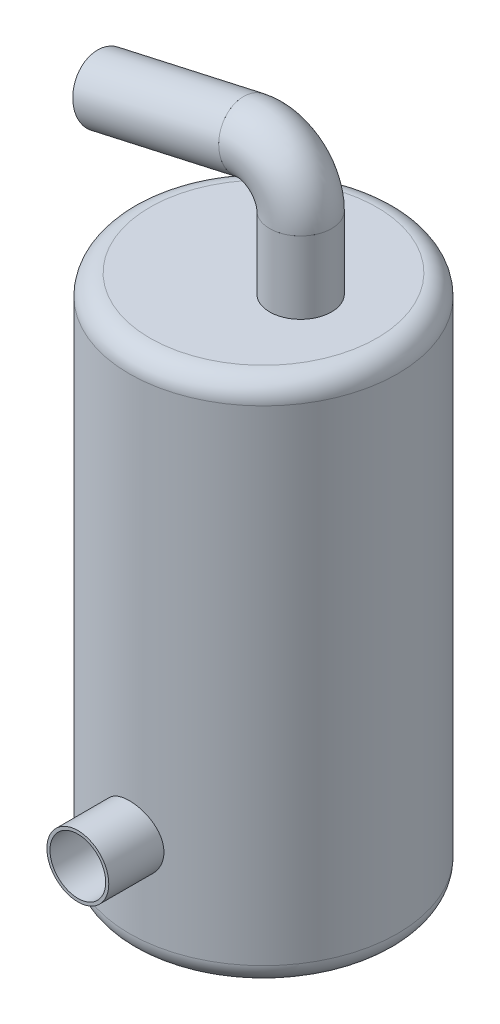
ISO-10303-21;
HEADER;
FILE_DESCRIPTION(('STEP AP214'),'2;1');
FILE_NAME('part.step','',(''),(''),'','','');
FILE_SCHEMA(('AUTOMOTIVE_DESIGN { 1 0 10303 214 1 1 1 1 }'));
ENDSEC;
DATA;
#1=APPLICATION_CONTEXT('core data for automotive mechanical design processes');
#2=APPLICATION_PROTOCOL_DEFINITION('international standard','automotive_design',2000,#1);
#3=PRODUCT_CONTEXT('',#1,'mechanical');
#4=PRODUCT('Part','Part','',(#3));
#5=PRODUCT_RELATED_PRODUCT_CATEGORY('part','',(#4));
#6=PRODUCT_DEFINITION_FORMATION('','',#4);
#7=PRODUCT_DEFINITION_CONTEXT('part definition',#1,'design');
#8=PRODUCT_DEFINITION('design','',#6,#7);
#9=PRODUCT_DEFINITION_SHAPE('','',#8);
#10=(LENGTH_UNIT() NAMED_UNIT(*) SI_UNIT(.MILLI.,.METRE.));
#11=(NAMED_UNIT(*) PLANE_ANGLE_UNIT() SI_UNIT($,.RADIAN.));
#12=(NAMED_UNIT(*) SI_UNIT($,.STERADIAN.) SOLID_ANGLE_UNIT());
#13=UNCERTAINTY_MEASURE_WITH_UNIT(LENGTH_MEASURE(1.E-05),#10,'distance_accuracy_value','');
#14=(GEOMETRIC_REPRESENTATION_CONTEXT(3) GLOBAL_UNCERTAINTY_ASSIGNED_CONTEXT((#13)) GLOBAL_UNIT_ASSIGNED_CONTEXT((#10,
#11,#12)) REPRESENTATION_CONTEXT('',''));
#15=CARTESIAN_POINT('',(0.,0.,0.));
#16=DIRECTION('',(0.,0.,1.));
#17=DIRECTION('',(1.,0.,0.));
#18=AXIS2_PLACEMENT_3D('',#15,#16,#17);
#19=CARTESIAN_POINT('',(-77.11683006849,293.702950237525,0.));
#20=DIRECTION('',(0.975916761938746,0.218143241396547,0.));
#21=DIRECTION('',(-0.218143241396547,0.975916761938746,0.));
#22=AXIS2_PLACEMENT_3D('',#19,#20,#21);
#23=CYLINDRICAL_SURFACE('',#22,13.5);
#24=CARTESIAN_POINT('',(-77.11683006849,293.702950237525,0.));
#25=DIRECTION('',(-0.975916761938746,-0.218143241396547,0.));
#26=DIRECTION('',(0.,0.,1.));
#27=AXIS2_PLACEMENT_3D('',#24,#25,#26);
#28=CIRCLE('',#27,13.5);
#29=CARTESIAN_POINT('',(-77.11683006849,293.702950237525,13.5));
#30=VERTEX_POINT('',#29);
#31=EDGE_CURVE('E50',#30,#30,#28,.T.);
#32=ORIENTED_EDGE('',*,*,#31,.T.);
#33=EDGE_LOOP('',(#32));
#34=FACE_BOUND('',#33,.T.);
#35=CARTESIAN_POINT('',(-6.36286482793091,309.518335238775,0.));
#36=DIRECTION('',(-0.975916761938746,-0.218143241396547,0.));
#37=DIRECTION('',(0.,0.,1.));
#38=AXIS2_PLACEMENT_3D('',#35,#36,#37);
#39=CIRCLE('',#38,13.5);
#40=CARTESIAN_POINT('',(-6.36286482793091,309.518335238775,13.5));
#41=VERTEX_POINT('',#40);
#42=EDGE_CURVE('E58',#41,#41,#39,.T.);
#43=ORIENTED_EDGE('',*,*,#42,.F.);
#44=EDGE_LOOP('',(#43));
#45=FACE_BOUND('',#44,.T.);
#46=ADVANCED_FACE('F44',(#34,#45),#23,.F.);
#47=CARTESIAN_POINT('',(-77.11683006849,293.702950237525,0.));
#48=DIRECTION('',(0.975916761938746,0.218143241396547,0.));
#49=DIRECTION('',(-0.218143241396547,0.975916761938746,0.));
#50=AXIS2_PLACEMENT_3D('',#47,#48,#49);
#51=CYLINDRICAL_SURFACE('',#50,15.);
#52=CARTESIAN_POINT('',(-77.11683006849,293.702950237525,0.));
#53=DIRECTION('',(-0.975916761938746,-0.218143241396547,0.));
#54=DIRECTION('',(0.,0.,1.));
#55=AXIS2_PLACEMENT_3D('',#52,#53,#54);
#56=CIRCLE('',#55,15.);
#57=CARTESIAN_POINT('',(-77.11683006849,293.702950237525,15.));
#58=VERTEX_POINT('',#57);
#59=EDGE_CURVE('E11',#58,#58,#56,.T.);
#60=ORIENTED_EDGE('',*,*,#59,.F.);
#61=EDGE_LOOP('',(#60));
#62=FACE_BOUND('',#61,.T.);
#63=CARTESIAN_POINT('',(-6.36286482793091,309.518335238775,0.));
#64=DIRECTION('',(-0.975916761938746,-0.218143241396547,0.));
#65=DIRECTION('',(0.,0.,1.));
#66=AXIS2_PLACEMENT_3D('',#63,#64,#65);
#67=CIRCLE('',#66,15.);
#68=CARTESIAN_POINT('',(-6.36286482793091,309.518335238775,15.));
#69=VERTEX_POINT('',#68);
#70=EDGE_CURVE('E54',#69,#69,#67,.T.);
#71=ORIENTED_EDGE('',*,*,#70,.T.);
#72=EDGE_LOOP('',(#71));
#73=FACE_BOUND('',#72,.T.);
#74=ADVANCED_FACE('F68',(#62,#73),#51,.T.);
#75=CARTESIAN_POINT('',(-77.11683006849,293.702950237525,0.));
#76=DIRECTION('',(-0.975916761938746,-0.218143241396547,0.));
#77=DIRECTION('',(0.,0.,1.));
#78=AXIS2_PLACEMENT_3D('',#75,#76,#77);
#79=PLANE('',#78);
#80=ORIENTED_EDGE('',*,*,#31,.F.);
#81=EDGE_LOOP('',(#80));
#82=FACE_BOUND('',#81,.T.);
#83=ORIENTED_EDGE('',*,*,#59,.T.);
#84=EDGE_LOOP('',(#83));
#85=FACE_BOUND('',#84,.T.);
#86=ADVANCED_FACE('F72',(#82,#85),#79,.T.);
#87=CARTESIAN_POINT('',(-6.36286482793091,309.518335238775,0.));
#88=DIRECTION('',(-0.975916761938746,-0.218143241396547,0.));
#89=DIRECTION('',(0.,0.,1.));
#90=AXIS2_PLACEMENT_3D('',#87,#88,#89);
#91=PLANE('',#90);
#92=ORIENTED_EDGE('',*,*,#42,.T.);
#93=EDGE_LOOP('',(#92));
#94=FACE_BOUND('',#93,.T.);
#95=ORIENTED_EDGE('',*,*,#70,.F.);
#96=EDGE_LOOP('',(#95));
#97=FACE_BOUND('',#96,.T.);
#98=ADVANCED_FACE('F64',(#94,#97),#91,.F.);
#99=CLOSED_SHELL('',(#46,#74,#86,#98));
#100=MANIFOLD_SOLID_BREP('B2',#99);
#101=CARTESIAN_POINT('',(-2.,290.,0.));
#102=DIRECTION('',(0.,0.,-1.));
#103=DIRECTION('',(-1.,0.,0.));
#104=AXIS2_PLACEMENT_3D('',#101,#102,#103);
#105=TOROIDAL_SURFACE('',#104,20.,13.5);
#106=CARTESIAN_POINT('',(-6.36286482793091,309.518335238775,0.));
#107=DIRECTION('',(-0.975916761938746,-0.218143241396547,0.));
#108=DIRECTION('',(0.,0.,1.));
#109=AXIS2_PLACEMENT_3D('',#106,#107,#108);
#110=CIRCLE('',#109,13.5);
#111=CARTESIAN_POINT('',(-9.30779858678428,322.693211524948,0.));
#112=VERTEX_POINT('',#111);
#113=EDGE_CURVE('E129',#112,#112,#110,.T.);
#114=CARTESIAN_POINT('',(18.,290.,0.));
#115=DIRECTION('',(0.,1.,0.));
#116=DIRECTION('',(0.,0.,1.));
#117=AXIS2_PLACEMENT_3D('',#114,#115,#116);
#118=CIRCLE('',#117,13.5);
#119=CARTESIAN_POINT('',(31.5,290.,0.));
#120=VERTEX_POINT('',#119);
#121=EDGE_CURVE('E137',#120,#120,#118,.T.);
#122=CARTESIAN_POINT('',(-2.,290.,0.));
#123=DIRECTION('',(0.,0.,-1.));
#124=DIRECTION('',(-1.,0.,0.));
#125=AXIS2_PLACEMENT_3D('',#122,#123,#124);
#126=CIRCLE('',#125,33.5);
#127=EDGE_CURVE('',#112,#120,#126,.T.);
#128=ORIENTED_EDGE('',*,*,#113,.T.);
#129=ORIENTED_EDGE('',*,*,#121,.F.);
#130=ORIENTED_EDGE('',*,*,#127,.T.);
#131=ORIENTED_EDGE('',*,*,#127,.F.);
#132=EDGE_LOOP('',(#128,#130,#129,#131));
#133=FACE_BOUND('',#132,.T.);
#134=ADVANCED_FACE('F122',(#133),#105,.F.);
#135=CARTESIAN_POINT('',(-2.,290.,0.));
#136=DIRECTION('',(0.,0.,-1.));
#137=DIRECTION('',(-1.,0.,0.));
#138=AXIS2_PLACEMENT_3D('',#135,#136,#137);
#139=TOROIDAL_SURFACE('',#138,20.,15.);
#140=CARTESIAN_POINT('',(-6.36286482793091,309.518335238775,0.));
#141=DIRECTION('',(-0.975916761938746,-0.218143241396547,0.));
#142=DIRECTION('',(0.,0.,1.));
#143=AXIS2_PLACEMENT_3D('',#140,#141,#142);
#144=CIRCLE('',#143,15.);
#145=CARTESIAN_POINT('',(-9.6350134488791,324.157086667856,0.));
#146=VERTEX_POINT('',#145);
#147=EDGE_CURVE('E43',#146,#146,#144,.T.);
#148=CARTESIAN_POINT('',(18.,290.,0.));
#149=DIRECTION('',(0.,1.,0.));
#150=DIRECTION('',(0.,0.,1.));
#151=AXIS2_PLACEMENT_3D('',#148,#149,#150);
#152=CIRCLE('',#151,15.);
#153=CARTESIAN_POINT('',(33.,290.,0.));
#154=VERTEX_POINT('',#153);
#155=EDGE_CURVE('E133',#154,#154,#152,.T.);
#156=CARTESIAN_POINT('',(-2.,290.,0.));
#157=DIRECTION('',(0.,0.,-1.));
#158=DIRECTION('',(-1.,0.,0.));
#159=AXIS2_PLACEMENT_3D('',#156,#157,#158);
#160=CIRCLE('',#159,35.);
#161=EDGE_CURVE('',#146,#154,#160,.T.);
#162=ORIENTED_EDGE('',*,*,#147,.F.);
#163=ORIENTED_EDGE('',*,*,#155,.T.);
#164=ORIENTED_EDGE('',*,*,#161,.T.);
#165=ORIENTED_EDGE('',*,*,#161,.F.);
#166=EDGE_LOOP('',(#162,#164,#163,#165));
#167=FACE_BOUND('',#166,.T.);
#168=ADVANCED_FACE('F124',(#167),#139,.T.);
#169=CARTESIAN_POINT('',(-6.36286482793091,309.518335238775,0.));
#170=DIRECTION('',(-0.975916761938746,-0.218143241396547,0.));
#171=DIRECTION('',(0.,0.,1.));
#172=AXIS2_PLACEMENT_3D('',#169,#170,#171);
#173=PLANE('',#172);
#174=ORIENTED_EDGE('',*,*,#113,.F.);
#175=EDGE_LOOP('',(#174));
#176=FACE_BOUND('',#175,.T.);
#177=ORIENTED_EDGE('',*,*,#147,.T.);
#178=EDGE_LOOP('',(#177));
#179=FACE_BOUND('',#178,.T.);
#180=ADVANCED_FACE('F147',(#176,#179),#173,.T.);
#181=CARTESIAN_POINT('',(18.,290.,0.));
#182=DIRECTION('',(0.,1.,0.));
#183=DIRECTION('',(0.,0.,1.));
#184=AXIS2_PLACEMENT_3D('',#181,#182,#183);
#185=PLANE('',#184);
#186=ORIENTED_EDGE('',*,*,#121,.T.);
#187=EDGE_LOOP('',(#186));
#188=FACE_BOUND('',#187,.T.);
#189=ORIENTED_EDGE('',*,*,#155,.F.);
#190=EDGE_LOOP('',(#189));
#191=FACE_BOUND('',#190,.T.);
#192=ADVANCED_FACE('F143',(#188,#191),#185,.F.);
#193=CLOSED_SHELL('',(#134,#168,#180,#192));
#194=MANIFOLD_SOLID_BREP('B6',#193);
#195=CARTESIAN_POINT('',(18.,290.,0.));
#196=DIRECTION('',(0.,-1.,0.));
#197=DIRECTION('',(0.,0.,-1.));
#198=AXIS2_PLACEMENT_3D('',#195,#196,#197);
#199=CYLINDRICAL_SURFACE('',#198,13.5);
#200=CARTESIAN_POINT('',(18.,290.,0.));
#201=DIRECTION('',(0.,1.,0.));
#202=DIRECTION('',(0.,0.,1.));
#203=AXIS2_PLACEMENT_3D('',#200,#201,#202);
#204=CIRCLE('',#203,13.5);
#205=CARTESIAN_POINT('',(18.,290.,13.5));
#206=VERTEX_POINT('',#205);
#207=EDGE_CURVE('E205',#206,#206,#204,.T.);
#208=ORIENTED_EDGE('',*,*,#207,.T.);
#209=EDGE_LOOP('',(#208));
#210=FACE_BOUND('',#209,.T.);
#211=CARTESIAN_POINT('',(18.,255.,0.));
#212=DIRECTION('',(0.,1.,0.));
#213=DIRECTION('',(0.,0.,1.));
#214=AXIS2_PLACEMENT_3D('',#211,#212,#213);
#215=CIRCLE('',#214,13.5);
#216=CARTESIAN_POINT('',(18.,255.,13.5));
#217=VERTEX_POINT('',#216);
#218=EDGE_CURVE('E213',#217,#217,#215,.T.);
#219=ORIENTED_EDGE('',*,*,#218,.F.);
#220=EDGE_LOOP('',(#219));
#221=FACE_BOUND('',#220,.T.);
#222=ADVANCED_FACE('F199',(#210,#221),#199,.F.);
#223=CARTESIAN_POINT('',(18.,290.,0.));
#224=DIRECTION('',(0.,-1.,0.));
#225=DIRECTION('',(0.,0.,-1.));
#226=AXIS2_PLACEMENT_3D('',#223,#224,#225);
#227=CYLINDRICAL_SURFACE('',#226,15.);
#228=CARTESIAN_POINT('',(18.,290.,0.));
#229=DIRECTION('',(0.,1.,0.));
#230=DIRECTION('',(0.,0.,1.));
#231=AXIS2_PLACEMENT_3D('',#228,#229,#230);
#232=CIRCLE('',#231,15.);
#233=CARTESIAN_POINT('',(18.,290.,15.));
#234=VERTEX_POINT('',#233);
#235=EDGE_CURVE('E121',#234,#234,#232,.T.);
#236=ORIENTED_EDGE('',*,*,#235,.F.);
#237=EDGE_LOOP('',(#236));
#238=FACE_BOUND('',#237,.T.);
#239=CARTESIAN_POINT('',(18.,255.,0.));
#240=DIRECTION('',(0.,1.,0.));
#241=DIRECTION('',(0.,0.,1.));
#242=AXIS2_PLACEMENT_3D('',#239,#240,#241);
#243=CIRCLE('',#242,15.);
#244=CARTESIAN_POINT('',(18.,255.,15.));
#245=VERTEX_POINT('',#244);
#246=EDGE_CURVE('E209',#245,#245,#243,.T.);
#247=ORIENTED_EDGE('',*,*,#246,.T.);
#248=EDGE_LOOP('',(#247));
#249=FACE_BOUND('',#248,.T.);
#250=ADVANCED_FACE('F223',(#238,#249),#227,.T.);
#251=CARTESIAN_POINT('',(18.,290.,0.));
#252=DIRECTION('',(0.,1.,0.));
#253=DIRECTION('',(0.,0.,1.));
#254=AXIS2_PLACEMENT_3D('',#251,#252,#253);
#255=PLANE('',#254);
#256=ORIENTED_EDGE('',*,*,#207,.F.);
#257=EDGE_LOOP('',(#256));
#258=FACE_BOUND('',#257,.T.);
#259=ORIENTED_EDGE('',*,*,#235,.T.);
#260=EDGE_LOOP('',(#259));
#261=FACE_BOUND('',#260,.T.);
#262=ADVANCED_FACE('F227',(#258,#261),#255,.T.);
#263=CARTESIAN_POINT('',(18.,255.,0.));
#264=DIRECTION('',(0.,1.,0.));
#265=DIRECTION('',(0.,0.,1.));
#266=AXIS2_PLACEMENT_3D('',#263,#264,#265);
#267=PLANE('',#266);
#268=ORIENTED_EDGE('',*,*,#218,.T.);
#269=EDGE_LOOP('',(#268));
#270=FACE_BOUND('',#269,.T.);
#271=ORIENTED_EDGE('',*,*,#246,.F.);
#272=EDGE_LOOP('',(#271));
#273=FACE_BOUND('',#272,.T.);
#274=ADVANCED_FACE('F219',(#270,#273),#267,.F.);
#275=CLOSED_SHELL('',(#222,#250,#262,#274));
#276=MANIFOLD_SOLID_BREP('B38',#275);
#277=CARTESIAN_POINT('',(0.,255.,0.));
#278=DIRECTION('',(0.,-1.,0.));
#279=DIRECTION('',(0.,0.,-1.));
#280=AXIS2_PLACEMENT_3D('',#277,#278,#279);
#281=CYLINDRICAL_SURFACE('',#280,65.);
#282=CARTESIAN_POINT('',(0.,245.,0.));
#283=DIRECTION('',(0.,1.,0.));
#284=DIRECTION('',(0.,0.,1.));
#285=AXIS2_PLACEMENT_3D('',#282,#283,#284);
#286=CIRCLE('',#285,65.);
#287=CARTESIAN_POINT('',(0.,245.,65.));
#288=VERTEX_POINT('',#287);
#289=EDGE_CURVE('E284',#288,#288,#286,.F.);
#290=ORIENTED_EDGE('',*,*,#289,.T.);
#291=EDGE_LOOP('',(#290));
#292=FACE_BOUND('',#291,.T.);
#293=CARTESIAN_POINT('',(0.,10.,0.));
#294=DIRECTION('',(0.,1.,0.));
#295=DIRECTION('',(0.,0.,1.));
#296=AXIS2_PLACEMENT_3D('',#293,#294,#295);
#297=CIRCLE('',#296,65.);
#298=CARTESIAN_POINT('',(0.,10.,65.));
#299=VERTEX_POINT('',#298);
#300=EDGE_CURVE('E289',#299,#299,#297,.T.);
#301=ORIENTED_EDGE('',*,*,#300,.T.);
#302=EDGE_LOOP('',(#301));
#303=FACE_BOUND('',#302,.T.);
#304=CARTESIAN_POINT('',(-15.,50.8107894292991,63.2455532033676));
#305=CARTESIAN_POINT('',(-14.9999979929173,50.3955335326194,63.2455543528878));
#306=CARTESIAN_POINT('',(-14.9827415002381,49.980235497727,63.2496540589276));
#307=CARTESIAN_POINT('',(-14.9138518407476,49.1526275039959,63.2659327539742));
#308=CARTESIAN_POINT('',(-14.8622139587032,48.7403179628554,63.2781128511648));
#309=CARTESIAN_POINT('',(-14.724948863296,47.9214427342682,63.3101954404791));
#310=CARTESIAN_POINT('',(-14.6393011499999,47.5148806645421,63.3301025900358));
#311=CARTESIAN_POINT('',(-14.4347188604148,46.7106613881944,63.3770454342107));
#312=CARTESIAN_POINT('',(-14.3157853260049,46.3130039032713,63.4040809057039));
#313=CARTESIAN_POINT('',(-14.0457301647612,45.5298000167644,63.4644512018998));
#314=CARTESIAN_POINT('',(-13.8946466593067,45.1442398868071,63.497778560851));
#315=CARTESIAN_POINT('',(-13.5613532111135,44.38734016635,63.5697942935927));
#316=CARTESIAN_POINT('',(-13.3791430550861,44.0160006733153,63.6084827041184));
#317=CARTESIAN_POINT('',(-12.9849272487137,43.2899993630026,63.6901260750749));
#318=CARTESIAN_POINT('',(-12.7729224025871,42.9353370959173,63.733080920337));
#319=CARTESIAN_POINT('',(-12.3205919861,42.2449663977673,63.8220661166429));
#320=CARTESIAN_POINT('',(-12.0802660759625,41.9092581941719,63.8680965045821));
#321=CARTESIAN_POINT('',(-11.5686191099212,41.2534399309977,63.9627692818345));
#322=CARTESIAN_POINT('',(-11.2968428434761,40.9336893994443,64.0114426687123));
#323=CARTESIAN_POINT('',(-10.7275109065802,40.3181117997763,64.1093122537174));
#324=CARTESIAN_POINT('',(-10.4299549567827,40.0222849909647,64.1585084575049));
#325=CARTESIAN_POINT('',(-9.81101299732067,39.4565023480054,64.25606710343));
#326=CARTESIAN_POINT('',(-9.48962506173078,39.1865486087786,64.3044294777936));
#327=CARTESIAN_POINT('',(-8.82515824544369,38.6743755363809,64.3989842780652));
#328=CARTESIAN_POINT('',(-8.4820792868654,38.432156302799,64.4451766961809));
#329=CARTESIAN_POINT('',(-7.77233120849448,37.9744634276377,64.5346440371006));
#330=CARTESIAN_POINT('',(-7.40543141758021,37.7593392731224,64.577878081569));
#331=CARTESIAN_POINT('',(-6.6542672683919,37.3608269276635,64.659596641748));
#332=CARTESIAN_POINT('',(-6.27000273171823,37.1774390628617,64.698081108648));
#333=CARTESIAN_POINT('',(-5.48684724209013,36.8438412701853,64.7691984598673));
#334=CARTESIAN_POINT('',(-5.08795770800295,36.6936281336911,64.8018319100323));
#335=CARTESIAN_POINT('',(-4.27839196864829,36.42757364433,64.860311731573));
#336=CARTESIAN_POINT('',(-3.86771599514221,36.3117316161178,64.8861582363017));
#337=CARTESIAN_POINT('',(-3.0448183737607,36.1170926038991,64.9299305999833));
#338=CARTESIAN_POINT('',(-2.63274755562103,36.0376869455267,64.9479862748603));
#339=CARTESIAN_POINT('',(-1.80313867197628,35.9136557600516,64.9763105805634));
#340=CARTESIAN_POINT('',(-1.3856006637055,35.8690298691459,64.9865792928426));
#341=CARTESIAN_POINT('',(-0.548179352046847,35.8149389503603,64.9990371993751));
#342=CARTESIAN_POINT('',(-0.128296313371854,35.8054700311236,65.0012272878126));
#343=CARTESIAN_POINT('',(0.710746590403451,35.8217634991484,64.9974679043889));
#344=CARTESIAN_POINT('',(1.12990646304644,35.8475255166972,64.9915185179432));
#345=CARTESIAN_POINT('',(1.95648452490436,35.933238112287,64.9718388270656));
#346=CARTESIAN_POINT('',(2.36397466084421,35.9925312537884,64.9582581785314));
#347=CARTESIAN_POINT('',(3.17239917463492,36.1443301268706,64.9237981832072));
#348=CARTESIAN_POINT('',(3.57333364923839,36.2368353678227,64.9029189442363));
#349=CARTESIAN_POINT('',(4.36588341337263,36.4543298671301,64.8544270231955));
#350=CARTESIAN_POINT('',(4.75749841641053,36.5793201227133,64.826814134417));
#351=CARTESIAN_POINT('',(5.52874476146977,36.8608251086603,64.765597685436));
#352=CARTESIAN_POINT('',(5.90837595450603,37.017340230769,64.73199405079));
#353=CARTESIAN_POINT('',(6.65610440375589,37.3621050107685,64.6594038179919));
#354=CARTESIAN_POINT('',(7.02408572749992,37.5505974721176,64.6203764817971));
#355=CARTESIAN_POINT('',(7.74289461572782,37.9570714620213,64.5381938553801));
#356=CARTESIAN_POINT('',(8.0937221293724,38.1750530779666,64.4950385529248));
#357=CARTESIAN_POINT('',(8.77600332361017,38.6390195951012,64.4057464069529));
#358=CARTESIAN_POINT('',(9.10745456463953,38.8850080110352,64.3596091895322));
#359=CARTESIAN_POINT('',(9.74882371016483,39.4033162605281,64.2655857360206));
#360=CARTESIAN_POINT('',(10.0587412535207,39.6756365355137,64.2176994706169));
#361=CARTESIAN_POINT('',(10.6619721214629,40.2514239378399,64.1203388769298));
#362=CARTESIAN_POINT('',(10.9547350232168,40.5554661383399,64.0708534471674));
#363=CARTESIAN_POINT('',(11.5136763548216,41.1872171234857,63.9727738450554));
#364=CARTESIAN_POINT('',(11.7798543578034,41.5149262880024,63.9241796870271));
#365=CARTESIAN_POINT('',(12.2838005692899,42.1918399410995,63.8292567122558));
#366=CARTESIAN_POINT('',(12.521567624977,42.5410453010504,63.7829279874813));
#367=CARTESIAN_POINT('',(12.9669869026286,43.258599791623,63.6938682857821));
#368=CARTESIAN_POINT('',(13.174639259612,43.6269488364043,63.6511372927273));
#369=CARTESIAN_POINT('',(13.5589932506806,44.3816621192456,63.5703738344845));
#370=CARTESIAN_POINT('',(13.7355795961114,44.7680869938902,63.5323590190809));
#371=CARTESIAN_POINT('',(14.0555000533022,45.5550011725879,63.4623491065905));
#372=CARTESIAN_POINT('',(14.1988339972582,45.955490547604,63.4303540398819));
#373=CARTESIAN_POINT('',(14.4510673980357,46.767596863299,63.3733649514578));
#374=CARTESIAN_POINT('',(14.5599718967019,47.1792121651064,63.3483699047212));
#375=CARTESIAN_POINT('',(14.7424555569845,48.0105904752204,63.306151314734));
#376=CARTESIAN_POINT('',(14.8160354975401,48.4303533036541,63.2889276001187));
#377=CARTESIAN_POINT('',(14.9259758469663,49.2653047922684,63.2630884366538));
#378=CARTESIAN_POINT('',(14.9631411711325,49.6803818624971,63.254286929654));
#379=CARTESIAN_POINT('',(15.0028094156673,50.5122794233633,63.2448901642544));
#380=CARTESIAN_POINT('',(15.0053128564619,50.9290998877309,63.2442947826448));
#381=CARTESIAN_POINT('',(14.9756377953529,51.761402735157,63.2513280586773));
#382=CARTESIAN_POINT('',(14.9434617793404,52.1768852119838,63.2589561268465));
#383=CARTESIAN_POINT('',(14.8447038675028,53.0035119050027,63.2822039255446));
#384=CARTESIAN_POINT('',(14.7781220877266,53.4146561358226,63.2978236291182));
#385=CARTESIAN_POINT('',(14.6122354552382,54.2241409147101,63.3363221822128));
#386=CARTESIAN_POINT('',(14.513384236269,54.622579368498,63.3591002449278));
#387=CARTESIAN_POINT('',(14.2835186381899,55.4096109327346,63.4113158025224));
#388=CARTESIAN_POINT('',(14.1525046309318,55.7982041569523,63.4407532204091));
#389=CARTESIAN_POINT('',(13.8592973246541,56.5629720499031,63.5054517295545));
#390=CARTESIAN_POINT('',(13.6971015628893,56.9391457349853,63.5407132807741));
#391=CARTESIAN_POINT('',(13.3427204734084,57.6765865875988,63.6160719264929));
#392=CARTESIAN_POINT('',(13.1505346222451,58.0378534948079,63.6561691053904));
#393=CARTESIAN_POINT('',(12.7340109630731,58.749158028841,63.7408101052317));
#394=CARTESIAN_POINT('',(12.5091826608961,59.0989008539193,63.7854178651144));
#395=CARTESIAN_POINT('',(12.0314669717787,59.778300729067,63.8772490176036));
#396=CARTESIAN_POINT('',(11.778579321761,60.1079575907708,63.9244724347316));
#397=CARTESIAN_POINT('',(11.2464143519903,60.7450971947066,64.0202408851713));
#398=CARTESIAN_POINT('',(10.967133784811,61.0525772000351,64.0687860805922));
#399=CARTESIAN_POINT('',(10.3840432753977,61.6433281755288,64.165870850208));
#400=CARTESIAN_POINT('',(10.0802331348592,61.9265989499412,64.2144104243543));
#401=CARTESIAN_POINT('',(9.44342756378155,62.4727486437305,64.3111773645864));
#402=CARTESIAN_POINT('',(9.10995328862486,62.7350745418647,64.3593767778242));
#403=CARTESIAN_POINT('',(8.42172481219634,63.2307082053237,64.453046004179));
#404=CARTESIAN_POINT('',(8.06697027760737,63.4640155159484,64.4985157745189));
#405=CARTESIAN_POINT('',(7.33860414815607,63.8999073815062,64.5854424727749));
#406=CARTESIAN_POINT('',(6.96499313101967,64.1024928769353,64.6268995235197));
#407=CARTESIAN_POINT('',(6.2014898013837,64.475415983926,64.7046269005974));
#408=CARTESIAN_POINT('',(5.81159770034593,64.6457540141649,64.7408972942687));
#409=CARTESIAN_POINT('',(5.02099250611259,64.9517966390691,64.8069895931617));
#410=CARTESIAN_POINT('',(4.62037132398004,65.0877294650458,64.8368537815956));
#411=CARTESIAN_POINT('',(3.80864847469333,65.3253694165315,64.8895954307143));
#412=CARTESIAN_POINT('',(3.39754683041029,65.427076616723,64.9124729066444));
#413=CARTESIAN_POINT('',(2.56792830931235,65.5954053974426,64.9505822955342));
#414=CARTESIAN_POINT('',(2.14941244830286,65.6620317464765,64.9658152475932));
#415=CARTESIAN_POINT('',(1.30803306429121,65.7596489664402,64.9881999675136));
#416=CARTESIAN_POINT('',(0.885169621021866,65.7906404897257,64.9953518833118));
#417=CARTESIAN_POINT('',(0.0480790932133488,65.8164205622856,65.0012986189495));
#418=CARTESIAN_POINT('',(-0.366121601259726,65.8120296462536,65.0002828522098));
#419=CARTESIAN_POINT('',(-1.19264255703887,65.7690260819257,64.9903716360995));
#420=CARTESIAN_POINT('',(-1.60496284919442,65.7304139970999,64.9814763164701));
#421=CARTESIAN_POINT('',(-2.42475582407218,65.6192890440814,64.956052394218));
#422=CARTESIAN_POINT('',(-2.83222863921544,65.5467771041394,64.9395240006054));
#423=CARTESIAN_POINT('',(-3.63945460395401,65.3684412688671,64.8992888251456));
#424=CARTESIAN_POINT('',(-4.03920772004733,65.2626172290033,64.8755820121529));
#425=CARTESIAN_POINT('',(-4.8266396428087,65.0189817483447,64.8217454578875));
#426=CARTESIAN_POINT('',(-5.21436022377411,64.881299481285,64.7916416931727));
#427=CARTESIAN_POINT('',(-5.9767706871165,64.5747649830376,64.7257648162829));
#428=CARTESIAN_POINT('',(-6.35146063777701,64.4059129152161,64.6899917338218));
#429=CARTESIAN_POINT('',(-7.0853775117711,64.0382568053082,64.6137258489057));
#430=CARTESIAN_POINT('',(-7.4446031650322,63.8394503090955,64.5732326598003));
#431=CARTESIAN_POINT('',(-8.14525053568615,63.4132904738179,64.4885992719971));
#432=CARTESIAN_POINT('',(-8.48667194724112,63.1859366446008,64.4444590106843));
#433=CARTESIAN_POINT('',(-9.15646889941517,62.699187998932,64.352744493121));
#434=CARTESIAN_POINT('',(-9.48442328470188,62.4392233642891,64.3051177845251));
#435=CARTESIAN_POINT('',(-10.1173720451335,61.8929173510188,64.2085765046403));
#436=CARTESIAN_POINT('',(-10.4223660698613,61.6065755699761,64.1596619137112));
#437=CARTESIAN_POINT('',(-11.0074581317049,61.0093509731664,64.0618754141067));
#438=CARTESIAN_POINT('',(-11.2875501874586,60.6984622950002,64.0130035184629));
#439=CARTESIAN_POINT('',(-11.8208856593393,60.0542480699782,63.9166654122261));
#440=CARTESIAN_POINT('',(-12.0741291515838,59.7209225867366,63.8691991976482));
#441=CARTESIAN_POINT('',(-12.5556970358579,59.0287531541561,63.7762929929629));
#442=CARTESIAN_POINT('',(-12.783580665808,58.6695966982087,63.7308951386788));
#443=CARTESIAN_POINT('',(-13.2082187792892,57.9328486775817,63.6442451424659));
#444=CARTESIAN_POINT('',(-13.4049733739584,57.5552571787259,63.6029929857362));
#445=CARTESIAN_POINT('',(-13.7657299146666,56.7845323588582,63.5258899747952));
#446=CARTESIAN_POINT('',(-13.9297545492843,56.3914100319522,63.4900353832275));
#447=CARTESIAN_POINT('',(-14.223900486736,55.592200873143,63.4247852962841));
#448=CARTESIAN_POINT('',(-14.3540275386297,55.1861162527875,63.3953887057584));
#449=CARTESIAN_POINT('',(-14.5549354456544,54.4529646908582,63.3495224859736));
#450=CARTESIAN_POINT('',(-14.6324651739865,54.1278171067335,63.3316320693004));
#451=CARTESIAN_POINT('',(-14.7656714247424,53.4728557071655,63.3007080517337));
#452=CARTESIAN_POINT('',(-14.8213495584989,53.1430422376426,63.2876740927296));
#453=CARTESIAN_POINT('',(-14.9105587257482,52.4802399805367,63.2667159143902));
#454=CARTESIAN_POINT('',(-14.9440876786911,52.1472508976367,63.2587921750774));
#455=CARTESIAN_POINT('',(-14.9888066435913,51.4797799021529,63.2482109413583));
#456=CARTESIAN_POINT('',(-15.0000016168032,51.1452983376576,63.2455522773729));
#457=CARTESIAN_POINT('',(-15.,50.8107894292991,63.2455532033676));
#458=B_SPLINE_CURVE_WITH_KNOTS('',3,(#304,#305,#306,#307,#308,#309,#310,#311,#312,#313,#314,
#315,#316,#317,#318,#319,#320,#321,#322,#323,#324,#325,#326,#327,#328,#329,#330,#331,#332,#333,
#334,#335,#336,#337,#338,#339,#340,#341,#342,#343,#344,#345,#346,#347,#348,#349,#350,#351,#352,
#353,#354,#355,#356,#357,#358,#359,#360,#361,#362,#363,#364,#365,#366,#367,#368,#369,#370,#371,
#372,#373,#374,#375,#376,#377,#378,#379,#380,#381,#382,#383,#384,#385,#386,#387,#388,#389,#390,
#391,#392,#393,#394,#395,#396,#397,#398,#399,#400,#401,#402,#403,#404,#405,#406,#407,#408,#409,
#410,#411,#412,#413,#414,#415,#416,#417,#418,#419,#420,#421,#422,#423,#424,#425,#426,#427,#428,
#429,#430,#431,#432,#433,#434,#435,#436,#437,#438,#439,#440,#441,#442,#443,#444,#445,#446,#447,
#448,#449,#450,#451,#452,#453,#454,#455,#456,#457),.UNSPECIFIED.,.T.,.F.,(4,2,2,2,2,2,2,2,2,2,2,
2,2,2,2,2,2,2,2,2,2,2,2,2,2,2,2,2,2,2,2,2,2,2,2,2,2,2,2,2,2,2,2,2,2,2,2,2,2,2,2,2,2,2,2,2,2,2,2,
2,2,2,2,2,2,2,2,2,2,2,2,2,2,2,2,2,4),(0.,1.24546329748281,2.49109743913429,3.73748354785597,
4.98383064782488,6.2287080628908,7.47359400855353,8.71844635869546,9.96331364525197,
11.2292209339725,12.49514194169,13.7611653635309,15.0271933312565,16.308166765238,
17.5891533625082,18.8700160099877,20.1508534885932,21.4094368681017,22.6680070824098,
23.9264379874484,25.1848556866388,26.4194152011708,27.6539564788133,28.8885356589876,
30.1231301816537,31.3675568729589,32.611987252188,33.8565739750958,35.1011815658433,
36.3745995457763,37.6480379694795,38.9215280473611,40.1950124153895,41.4731274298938,
42.7512488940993,44.0291831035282,45.3070891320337,46.5560641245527,47.8050203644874,
49.0538870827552,50.3027495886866,51.534761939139,52.7667600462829,53.9988554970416,
55.2309724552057,56.4840090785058,57.7370574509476,58.9902602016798,60.2434730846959,
61.5229983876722,62.8025437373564,64.0820499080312,65.3615394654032,66.6323047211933,
67.9030672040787,69.1736569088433,70.4442233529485,71.6854110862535,72.9265783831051,
74.1677116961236,75.4088503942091,76.6450422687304,77.8812276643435,79.1175143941,
80.3538223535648,81.6159401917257,82.8780772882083,84.1405167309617,85.4029525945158,
86.6847121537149,87.9664671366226,89.2473304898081,90.52797646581,91.5314607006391,
92.5348709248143,93.5383753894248,94.541656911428),.UNSPECIFIED.);
#459=CARTESIAN_POINT('',(-15.,50.8107894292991,63.2455532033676));
#460=VERTEX_POINT('',#459);
#461=EDGE_CURVE('E198',#460,#460,#458,.T.);
#462=ORIENTED_EDGE('',*,*,#461,.F.);
#463=EDGE_LOOP('',(#462));
#464=FACE_BOUND('',#463,.T.);
#465=ADVANCED_FACE('F269',(#292,#303,#464),#281,.T.);
#466=CARTESIAN_POINT('',(0.,255.,0.));
#467=DIRECTION('',(0.,1.,0.));
#468=DIRECTION('',(0.,0.,1.));
#469=AXIS2_PLACEMENT_3D('',#466,#467,#468);
#470=PLANE('',#469);
#471=CARTESIAN_POINT('',(0.,255.,0.));
#472=DIRECTION('',(0.,1.,0.));
#473=DIRECTION('',(0.,0.,1.));
#474=AXIS2_PLACEMENT_3D('',#471,#472,#473);
#475=CIRCLE('',#474,55.);
#476=CARTESIAN_POINT('',(0.,255.,55.));
#477=VERTEX_POINT('',#476);
#478=EDGE_CURVE('E297',#477,#477,#475,.T.);
#479=ORIENTED_EDGE('',*,*,#478,.T.);
#480=EDGE_LOOP('',(#479));
#481=FACE_BOUND('',#480,.T.);
#482=ADVANCED_FACE('F322',(#481),#470,.T.);
#483=CARTESIAN_POINT('',(0.,0.,0.));
#484=DIRECTION('',(0.,1.,0.));
#485=DIRECTION('',(0.,0.,1.));
#486=AXIS2_PLACEMENT_3D('',#483,#484,#485);
#487=PLANE('',#486);
#488=CARTESIAN_POINT('',(0.,0.,0.));
#489=DIRECTION('',(0.,1.,0.));
#490=DIRECTION('',(0.,0.,1.));
#491=AXIS2_PLACEMENT_3D('',#488,#489,#490);
#492=CIRCLE('',#491,55.);
#493=CARTESIAN_POINT('',(0.,0.,55.));
#494=VERTEX_POINT('',#493);
#495=EDGE_CURVE('E280',#494,#494,#492,.F.);
#496=ORIENTED_EDGE('',*,*,#495,.T.);
#497=EDGE_LOOP('',(#496));
#498=FACE_BOUND('',#497,.T.);
#499=ADVANCED_FACE('F319',(#498),#487,.F.);
#500=CARTESIAN_POINT('',(0.,245.,0.));
#501=DIRECTION('',(0.,1.,0.));
#502=DIRECTION('',(0.,0.,1.));
#503=AXIS2_PLACEMENT_3D('',#500,#501,#502);
#504=TOROIDAL_SURFACE('',#503,55.,10.);
#505=ORIENTED_EDGE('',*,*,#289,.F.);
#506=EDGE_LOOP('',(#505));
#507=FACE_BOUND('',#506,.T.);
#508=ORIENTED_EDGE('',*,*,#478,.F.);
#509=EDGE_LOOP('',(#508));
#510=FACE_BOUND('',#509,.T.);
#511=ADVANCED_FACE('F315',(#507,#510),#504,.T.);
#512=CARTESIAN_POINT('',(0.,10.,0.));
#513=DIRECTION('',(0.,1.,0.));
#514=DIRECTION('',(0.,0.,1.));
#515=AXIS2_PLACEMENT_3D('',#512,#513,#514);
#516=TOROIDAL_SURFACE('',#515,55.,10.);
#517=ORIENTED_EDGE('',*,*,#495,.F.);
#518=EDGE_LOOP('',(#517));
#519=FACE_BOUND('',#518,.T.);
#520=ORIENTED_EDGE('',*,*,#300,.F.);
#521=EDGE_LOOP('',(#520));
#522=FACE_BOUND('',#521,.T.);
#523=ADVANCED_FACE('F311',(#519,#522),#516,.T.);
#524=CARTESIAN_POINT('',(0.,50.8107894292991,90.));
#525=DIRECTION('',(0.,0.,-1.));
#526=DIRECTION('',(-1.,0.,0.));
#527=AXIS2_PLACEMENT_3D('',#524,#525,#526);
#528=CYLINDRICAL_SURFACE('',#527,15.);
#529=CARTESIAN_POINT('',(0.,50.8107894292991,90.));
#530=DIRECTION('',(0.,0.,1.));
#531=DIRECTION('',(1.,0.,0.));
#532=AXIS2_PLACEMENT_3D('',#529,#530,#531);
#533=CIRCLE('',#532,15.);
#534=CARTESIAN_POINT('',(15.,50.8107894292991,90.));
#535=VERTEX_POINT('',#534);
#536=EDGE_CURVE('E298',#535,#535,#533,.T.);
#537=ORIENTED_EDGE('',*,*,#536,.F.);
#538=EDGE_LOOP('',(#537));
#539=FACE_BOUND('',#538,.T.);
#540=ORIENTED_EDGE('',*,*,#461,.T.);
#541=EDGE_LOOP('',(#540));
#542=FACE_BOUND('',#541,.T.);
#543=ADVANCED_FACE('F304',(#539,#542),#528,.T.);
#544=CARTESIAN_POINT('',(0.,50.8107894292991,90.));
#545=DIRECTION('',(0.,0.,-1.));
#546=DIRECTION('',(-1.,0.,0.));
#547=AXIS2_PLACEMENT_3D('',#544,#545,#546);
#548=CYLINDRICAL_SURFACE('',#547,13.5);
#549=CARTESIAN_POINT('',(0.,50.8107894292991,90.));
#550=DIRECTION('',(0.,0.,1.));
#551=DIRECTION('',(1.,0.,0.));
#552=AXIS2_PLACEMENT_3D('',#549,#550,#551);
#553=CIRCLE('',#552,13.5);
#554=CARTESIAN_POINT('',(13.5,50.8107894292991,90.));
#555=VERTEX_POINT('',#554);
#556=EDGE_CURVE('E337',#555,#555,#553,.T.);
#557=ORIENTED_EDGE('',*,*,#556,.T.);
#558=EDGE_LOOP('',(#557));
#559=FACE_BOUND('',#558,.T.);
#560=CARTESIAN_POINT('',(-13.5,50.8107894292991,63.5826234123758));
#561=CARTESIAN_POINT('',(-13.5000079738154,50.4359274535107,63.582618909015));
#562=CARTESIAN_POINT('',(-13.4843826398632,50.0611630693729,63.5859445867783));
#563=CARTESIAN_POINT('',(-13.4220232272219,49.3142360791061,63.5991383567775));
#564=CARTESIAN_POINT('',(-13.3752841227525,48.942073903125,63.6090075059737));
#565=CARTESIAN_POINT('',(-13.2510183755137,48.202897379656,63.6350100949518));
#566=CARTESIAN_POINT('',(-13.173470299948,47.835886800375,63.6511478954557));
#567=CARTESIAN_POINT('',(-12.9882106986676,47.1098814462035,63.6892088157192));
#568=CARTESIAN_POINT('',(-12.8805003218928,46.7508863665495,63.7111317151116));
#569=CARTESIAN_POINT('',(-12.6358767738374,46.0437734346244,63.7600983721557));
#570=CARTESIAN_POINT('',(-12.4989940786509,45.6956446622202,63.7871367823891));
#571=CARTESIAN_POINT('',(-12.1969843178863,45.0122432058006,63.845573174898));
#572=CARTESIAN_POINT('',(-12.0318570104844,44.676970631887,63.876971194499));
#573=CARTESIAN_POINT('',(-11.6745670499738,44.0215490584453,63.9432363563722));
#574=CARTESIAN_POINT('',(-11.4824063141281,43.7013989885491,63.9781032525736));
#575=CARTESIAN_POINT('',(-11.0723840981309,43.0782989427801,64.050336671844));
#576=CARTESIAN_POINT('',(-10.8545222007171,42.7753492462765,64.0877032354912));
#577=CARTESIAN_POINT('',(-10.3914303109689,42.1846112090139,64.1644293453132));
#578=CARTESIAN_POINT('',(-10.1458666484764,41.8970870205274,64.2038091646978));
#579=CARTESIAN_POINT('',(-9.631527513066,41.3436681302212,64.2829787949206));
#580=CARTESIAN_POINT('',(-9.36275183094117,41.0777736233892,64.3227686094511));
#581=CARTESIAN_POINT('',(-8.80377636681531,40.5693902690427,64.4016550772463));
#582=CARTESIAN_POINT('',(-8.5135750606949,40.3269030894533,64.4407516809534));
#583=CARTESIAN_POINT('',(-7.91370647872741,39.86702024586,64.5171655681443));
#584=CARTESIAN_POINT('',(-7.60403914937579,39.6496246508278,64.554482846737));
#585=CARTESIAN_POINT('',(-6.96430258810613,39.2395229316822,64.626643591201));
#586=CARTESIAN_POINT('',(-6.63406809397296,39.0470697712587,64.6614603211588));
#587=CARTESIAN_POINT('',(-5.95816366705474,38.6907133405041,64.7272397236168));
#588=CARTESIAN_POINT('',(-5.61249360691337,38.5268103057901,64.7582023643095));
#589=CARTESIAN_POINT('',(-4.90818110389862,38.2288198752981,64.8153883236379));
#590=CARTESIAN_POINT('',(-4.54953967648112,38.0947301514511,64.8416120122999));
#591=CARTESIAN_POINT('',(-3.82183802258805,37.8574109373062,64.8885696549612));
#592=CARTESIAN_POINT('',(-3.45277796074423,37.7541809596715,64.9093036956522));
#593=CARTESIAN_POINT('',(-2.71222995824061,37.5806577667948,64.9444321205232));
#594=CARTESIAN_POINT('',(-2.34085060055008,37.5099183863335,64.9589122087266));
#595=CARTESIAN_POINT('',(-1.59327813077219,37.3998160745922,64.9815458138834));
#596=CARTESIAN_POINT('',(-1.21708505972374,37.3604528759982,64.9896993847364));
#597=CARTESIAN_POINT('',(-0.462672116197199,37.3134281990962,64.9994479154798));
#598=CARTESIAN_POINT('',(-0.0844524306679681,37.305763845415,65.0010434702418));
#599=CARTESIAN_POINT('',(0.671264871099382,37.3221925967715,64.9976321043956));
#600=CARTESIAN_POINT('',(1.04876249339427,37.3462854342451,64.9926252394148));
#601=CARTESIAN_POINT('',(1.79448189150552,37.4254145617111,64.9762787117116));
#602=CARTESIAN_POINT('',(2.16275704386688,37.4799693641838,64.9650376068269));
#603=CARTESIAN_POINT('',(2.89331977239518,37.6192399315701,64.9366024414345));
#604=CARTESIAN_POINT('',(3.25560742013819,37.7039553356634,64.9194084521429));
#605=CARTESIAN_POINT('',(3.97168621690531,37.9028925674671,64.879536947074));
#606=CARTESIAN_POINT('',(4.32547713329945,38.0171152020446,64.856859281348));
#607=CARTESIAN_POINT('',(5.0221369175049,38.2742028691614,64.8066363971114));
#608=CARTESIAN_POINT('',(5.36500567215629,38.4170681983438,64.7790911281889));
#609=CARTESIAN_POINT('',(6.03977538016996,38.7314443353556,64.7196771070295));
#610=CARTESIAN_POINT('',(6.371587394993,38.9031407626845,64.6877806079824));
#611=CARTESIAN_POINT('',(7.01959621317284,39.2732637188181,64.6206731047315));
#612=CARTESIAN_POINT('',(7.3357929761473,39.4716903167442,64.5854620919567));
#613=CARTESIAN_POINT('',(7.9505258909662,39.8939128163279,64.5126728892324));
#614=CARTESIAN_POINT('',(8.24906020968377,40.1177113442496,64.4750944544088));
#615=CARTESIAN_POINT('',(8.82648983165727,40.589145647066,64.3985862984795));
#616=CARTESIAN_POINT('',(9.10538487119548,40.8367817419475,64.3596565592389));
#617=CARTESIAN_POINT('',(9.64676283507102,41.3591180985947,64.2807608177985));
#618=CARTESIAN_POINT('',(9.90883862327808,41.6342396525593,64.2407890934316));
#619=CARTESIAN_POINT('',(10.4089312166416,42.2056568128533,64.1616572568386));
#620=CARTESIAN_POINT('',(10.6469477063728,42.5019526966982,64.1224971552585));
#621=CARTESIAN_POINT('',(11.0972731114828,43.1137253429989,64.0460983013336));
#622=CARTESIAN_POINT('',(11.3095813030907,43.4292026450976,64.0088596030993));
#623=CARTESIAN_POINT('',(11.7069670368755,44.0771892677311,63.9373732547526));
#624=CARTESIAN_POINT('',(11.8920446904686,44.4096985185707,63.9031255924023));
#625=CARTESIAN_POINT('',(12.2340312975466,45.0903103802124,63.8385373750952));
#626=CARTESIAN_POINT('',(12.3908693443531,45.4384495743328,63.8082067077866));
#627=CARTESIAN_POINT('',(12.6746100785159,46.1471070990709,63.7524523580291));
#628=CARTESIAN_POINT('',(12.801512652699,46.5076254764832,63.7270286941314));
#629=CARTESIAN_POINT('',(13.0243625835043,47.2384109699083,63.6818570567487));
#630=CARTESIAN_POINT('',(13.1203135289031,47.6086769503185,63.6621084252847));
#631=CARTESIAN_POINT('',(13.2804946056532,48.3562836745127,63.6288862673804));
#632=CARTESIAN_POINT('',(13.3447252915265,48.7336242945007,63.6154126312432));
#633=CARTESIAN_POINT('',(13.4400436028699,49.4855723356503,63.5953422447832));
#634=CARTESIAN_POINT('',(13.4717203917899,49.8601019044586,63.5886232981));
#635=CARTESIAN_POINT('',(13.5037384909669,50.6105564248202,63.581831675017));
#636=CARTESIAN_POINT('',(13.5040801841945,50.9864813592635,63.581758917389));
#637=CARTESIAN_POINT('',(13.4734266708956,51.7369703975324,63.5882616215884));
#638=CARTESIAN_POINT('',(13.4424332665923,52.1115345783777,63.5948367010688));
#639=CARTESIAN_POINT('',(13.3493659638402,52.8566087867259,63.6144377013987));
#640=CARTESIAN_POINT('',(13.2872921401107,53.2271188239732,63.62746360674));
#641=CARTESIAN_POINT('',(13.1333788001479,53.9575673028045,63.659409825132));
#642=CARTESIAN_POINT('',(13.0418586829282,54.317575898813,63.6782668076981));
#643=CARTESIAN_POINT('',(12.8295863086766,55.0285310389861,63.7213734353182));
#644=CARTESIAN_POINT('',(12.7088343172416,55.3794776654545,63.7456230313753));
#645=CARTESIAN_POINT('',(12.4389939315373,56.0699562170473,63.7988270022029));
#646=CARTESIAN_POINT('',(12.2899036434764,56.4094873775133,63.8277816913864));
#647=CARTESIAN_POINT('',(11.9644720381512,57.0748592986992,63.8895830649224));
#648=CARTESIAN_POINT('',(11.788130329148,57.4006998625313,63.9224298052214));
#649=CARTESIAN_POINT('',(11.406782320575,58.0410111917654,63.9915883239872));
#650=CARTESIAN_POINT('',(11.2014096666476,58.3552592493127,64.0279421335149));
#651=CARTESIAN_POINT('',(10.765350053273,58.9654109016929,64.1027000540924));
#652=CARTESIAN_POINT('',(10.534662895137,59.2613143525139,64.1411041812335));
#653=CARTESIAN_POINT('',(10.0495178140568,59.83285745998,64.2189032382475));
#654=CARTESIAN_POINT('',(9.79505753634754,60.1084951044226,64.2582982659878));
#655=CARTESIAN_POINT('',(9.26408184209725,60.6376544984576,64.3369940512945));
#656=CARTESIAN_POINT('',(8.98756629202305,60.8911761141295,64.3762948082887));
#657=CARTESIAN_POINT('',(8.40951639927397,61.3784426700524,64.4543752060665));
#658=CARTESIAN_POINT('',(8.1076416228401,61.6117871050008,64.493135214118));
#659=CARTESIAN_POINT('',(7.48503152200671,62.0522177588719,64.5683561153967));
#660=CARTESIAN_POINT('',(7.1642959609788,62.2593036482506,64.6048169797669));
#661=CARTESIAN_POINT('',(6.50617621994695,62.6457068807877,64.6744086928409));
#662=CARTESIAN_POINT('',(6.16879251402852,62.8250250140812,64.7075396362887));
#663=CARTESIAN_POINT('',(5.47971969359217,63.154553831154,64.7695323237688));
#664=CARTESIAN_POINT('',(5.12803073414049,63.3047648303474,64.7983941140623));
#665=CARTESIAN_POINT('',(4.41500031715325,63.5741013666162,64.850865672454));
#666=CARTESIAN_POINT('',(4.05372995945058,63.693409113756,64.8745060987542));
#667=CARTESIAN_POINT('',(3.32210049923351,63.901177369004,64.9160834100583));
#668=CARTESIAN_POINT('',(2.95174141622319,63.989637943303,64.9340203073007));
#669=CARTESIAN_POINT('',(2.20467313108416,64.1349858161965,64.9636755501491));
#670=CARTESIAN_POINT('',(1.82796462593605,64.1918765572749,64.9753945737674));
#671=CARTESIAN_POINT('',(1.07094381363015,64.2736276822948,64.9922795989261));
#672=CARTESIAN_POINT('',(0.690631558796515,64.2984885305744,64.9974456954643));
#673=CARTESIAN_POINT('',(-0.0636111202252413,64.3158096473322,65.0010423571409));
#674=CARTESIAN_POINT('',(-0.437527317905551,64.3088694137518,64.9995975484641));
#675=CARTESIAN_POINT('',(-1.18341238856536,64.2640091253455,64.990296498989));
#676=CARTESIAN_POINT('',(-1.55538128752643,64.2260894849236,64.9824403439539));
#677=CARTESIAN_POINT('',(-2.29470587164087,64.1195764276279,64.9605349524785));
#678=CARTESIAN_POINT('',(-2.66206164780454,64.0509836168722,64.9464858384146));
#679=CARTESIAN_POINT('',(-3.3895711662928,63.8836669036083,64.9125829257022));
#680=CARTESIAN_POINT('',(-3.74972487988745,63.7849428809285,64.8927291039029));
#681=CARTESIAN_POINT('',(-4.4593770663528,63.5584291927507,64.8478221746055));
#682=CARTESIAN_POINT('',(-4.80890128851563,63.430717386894,64.8227830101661));
#683=CARTESIAN_POINT('',(-5.49591443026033,63.1470385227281,64.7681532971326));
#684=CARTESIAN_POINT('',(-5.83340339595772,62.9910715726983,64.7385627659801));
#685=CARTESIAN_POINT('',(-6.49412014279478,62.6520010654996,64.6756256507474));
#686=CARTESIAN_POINT('',(-6.81734700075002,62.4688957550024,64.6422788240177));
#687=CARTESIAN_POINT('',(-7.4474020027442,62.076839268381,64.5727239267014));
#688=CARTESIAN_POINT('',(-7.75422991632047,61.8678877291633,64.5365158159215));
#689=CARTESIAN_POINT('',(-8.35464924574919,61.4217333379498,64.4615618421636));
#690=CARTESIAN_POINT('',(-8.64792004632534,61.1841044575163,64.4227829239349));
#691=CARTESIAN_POINT('',(-9.21348045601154,60.6851995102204,64.344333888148));
#692=CARTESIAN_POINT('',(-9.48576978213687,60.4239231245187,64.3046637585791));
#693=CARTESIAN_POINT('',(-10.0076059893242,59.8794195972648,64.2255206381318));
#694=CARTESIAN_POINT('',(-10.2571474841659,59.5961872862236,64.1860476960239));
#695=CARTESIAN_POINT('',(-10.731721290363,59.0097192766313,64.1084080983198));
#696=CARTESIAN_POINT('',(-10.9567537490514,58.706483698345,64.070241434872));
#697=CARTESIAN_POINT('',(-11.3832628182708,58.078329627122,63.9958495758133));
#698=CARTESIAN_POINT('',(-11.584429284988,57.7531970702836,63.9596526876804));
#699=CARTESIAN_POINT('',(-11.9586038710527,57.0867625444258,63.8907504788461));
#700=CARTESIAN_POINT('',(-12.131612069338,56.7454606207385,63.8580451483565));
#701=CARTESIAN_POINT('',(-12.4480443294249,56.0493224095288,63.7971172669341));
#702=CARTESIAN_POINT('',(-12.5914911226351,55.6944967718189,63.7688912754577));
#703=CARTESIAN_POINT('',(-12.8478145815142,54.9737237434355,63.7177422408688));
#704=CARTESIAN_POINT('',(-12.9606969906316,54.6077784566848,63.6948182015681));
#705=CARTESIAN_POINT('',(-13.2042630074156,53.6795534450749,63.6448759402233));
#706=CARTESIAN_POINT('',(-13.3150068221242,53.1117053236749,63.6216644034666));
#707=CARTESIAN_POINT('',(-13.4628677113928,51.9660904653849,63.5905419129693));
#708=CARTESIAN_POINT('',(-13.4999877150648,51.3883241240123,63.5826303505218));
#709=CARTESIAN_POINT('',(-13.5,50.8107894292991,63.5826234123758));
#710=B_SPLINE_CURVE_WITH_KNOTS('',3,(#560,#561,#562,#563,#564,#565,#566,#567,#568,#569,#570,
#571,#572,#573,#574,#575,#576,#577,#578,#579,#580,#581,#582,#583,#584,#585,#586,#587,#588,#589,
#590,#591,#592,#593,#594,#595,#596,#597,#598,#599,#600,#601,#602,#603,#604,#605,#606,#607,#608,
#609,#610,#611,#612,#613,#614,#615,#616,#617,#618,#619,#620,#621,#622,#623,#624,#625,#626,#627,
#628,#629,#630,#631,#632,#633,#634,#635,#636,#637,#638,#639,#640,#641,#642,#643,#644,#645,#646,
#647,#648,#649,#650,#651,#652,#653,#654,#655,#656,#657,#658,#659,#660,#661,#662,#663,#664,#665,
#666,#667,#668,#669,#670,#671,#672,#673,#674,#675,#676,#677,#678,#679,#680,#681,#682,#683,#684,
#685,#686,#687,#688,#689,#690,#691,#692,#693,#694,#695,#696,#697,#698,#699,#700,#701,#702,#703,
#704,#705,#706,#707,#708,#709),.UNSPECIFIED.,.T.,.F.,(4,2,2,2,2,2,2,2,2,2,2,2,2,2,2,2,2,2,2,2,2,
2,2,2,2,2,2,2,2,2,2,2,2,2,2,2,2,2,2,2,2,2,2,2,2,2,2,2,2,2,2,2,2,2,2,2,2,2,2,2,2,2,2,2,2,2,2,2,2,
2,2,2,2,2,4),(0.,1.12407791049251,2.24833743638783,3.37338044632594,4.49838060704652,
5.62221120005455,6.74605141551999,7.86981196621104,8.99359076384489,10.1327452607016,
11.2719100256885,12.4111559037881,13.5504049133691,14.7004290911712,15.8504627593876,
17.0004065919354,18.1503322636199,19.2839566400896,20.4175713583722,21.5510832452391,
22.6845855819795,23.8006590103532,24.9167190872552,26.0328096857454,27.1489118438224,
28.2724963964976,29.3960838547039,30.5197877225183,31.6435066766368,32.7883522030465,
33.9332127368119,35.0781054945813,36.222993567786,37.3707174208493,38.5184456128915,
39.6660406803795,40.8136156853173,41.9400351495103,43.066440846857,44.1927817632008,
45.3191199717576,46.4336310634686,47.5481320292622,48.6627075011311,49.777298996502,
50.9074765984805,52.0376630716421,53.1679616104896,54.298266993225,55.4474296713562,
56.5966067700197,57.7457511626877,58.8948831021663,60.0370768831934,61.17926821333,
62.321334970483,63.463385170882,64.5839955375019,65.7045909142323,66.8251641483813,
67.9457418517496,69.0633446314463,70.180943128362,71.2986138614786,72.4163002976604,
73.5533130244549,74.6903410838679,75.827637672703,76.9649274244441,78.1156707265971,
79.2664108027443,80.416262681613,81.5658983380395,83.297788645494,85.0296100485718),.UNSPECIFIED.);
#711=CARTESIAN_POINT('',(-13.5,50.8107894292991,63.5826234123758));
#712=VERTEX_POINT('',#711);
#713=EDGE_CURVE('E292',#712,#712,#710,.T.);
#714=ORIENTED_EDGE('',*,*,#713,.F.);
#715=EDGE_LOOP('',(#714));
#716=FACE_BOUND('',#715,.T.);
#717=ADVANCED_FACE('F299',(#559,#716),#548,.F.);
#718=CARTESIAN_POINT('',(0.,50.8107894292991,90.));
#719=DIRECTION('',(0.,0.,1.));
#720=DIRECTION('',(1.,0.,0.));
#721=AXIS2_PLACEMENT_3D('',#718,#719,#720);
#722=PLANE('',#721);
#723=ORIENTED_EDGE('',*,*,#536,.T.);
#724=EDGE_LOOP('',(#723));
#725=FACE_BOUND('',#724,.T.);
#726=ORIENTED_EDGE('',*,*,#556,.F.);
#727=EDGE_LOOP('',(#726));
#728=FACE_BOUND('',#727,.T.);
#729=ADVANCED_FACE('F303',(#725,#728),#722,.T.);
#730=ORIENTED_EDGE('',*,*,#713,.T.);
#731=EDGE_LOOP('',(#730));
#732=FACE_BOUND('',#731,.T.);
#733=ADVANCED_FACE('F271',(#732),#281,.T.);
#734=CLOSED_SHELL('',(#465,#482,#499,#511,#523,#543,#717,#729,#733));
#735=MANIFOLD_SOLID_BREP('B116',#734);
#736=ADVANCED_BREP_SHAPE_REPRESENTATION('',(#18,#100,#194,#276,#735),#14);
#737=SHAPE_DEFINITION_REPRESENTATION(#9,#736);
ENDSEC;
END-ISO-10303-21;
